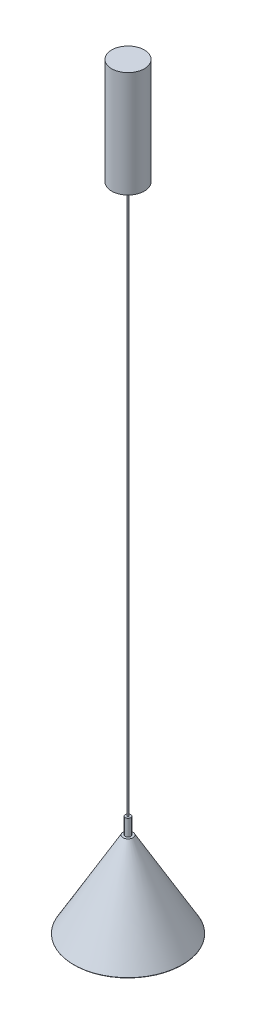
ISO-10303-21;
HEADER;
FILE_DESCRIPTION(('STEP AP214'),'2;1');
FILE_NAME('part.step','',(''),(''),'','','');
FILE_SCHEMA(('AUTOMOTIVE_DESIGN { 1 0 10303 214 1 1 1 1 }'));
ENDSEC;
DATA;
#1=APPLICATION_CONTEXT('core data for automotive mechanical design processes');
#2=APPLICATION_PROTOCOL_DEFINITION('international standard','automotive_design',2000,#1);
#3=PRODUCT_CONTEXT('',#1,'mechanical');
#4=PRODUCT('Part','Part','',(#3));
#5=PRODUCT_RELATED_PRODUCT_CATEGORY('part','',(#4));
#6=PRODUCT_DEFINITION_FORMATION('','',#4);
#7=PRODUCT_DEFINITION_CONTEXT('part definition',#1,'design');
#8=PRODUCT_DEFINITION('design','',#6,#7);
#9=PRODUCT_DEFINITION_SHAPE('','',#8);
#10=(LENGTH_UNIT() NAMED_UNIT(*) SI_UNIT(.MILLI.,.METRE.));
#11=(NAMED_UNIT(*) PLANE_ANGLE_UNIT() SI_UNIT($,.RADIAN.));
#12=(NAMED_UNIT(*) SI_UNIT($,.STERADIAN.) SOLID_ANGLE_UNIT());
#13=UNCERTAINTY_MEASURE_WITH_UNIT(LENGTH_MEASURE(1.E-05),#10,'distance_accuracy_value','');
#14=(GEOMETRIC_REPRESENTATION_CONTEXT(3) GLOBAL_UNCERTAINTY_ASSIGNED_CONTEXT((#13)) GLOBAL_UNIT_ASSIGNED_CONTEXT((#10,
#11,#12)) REPRESENTATION_CONTEXT('',''));
#15=CARTESIAN_POINT('',(0.,0.,0.));
#16=DIRECTION('',(0.,0.,1.));
#17=DIRECTION('',(1.,0.,0.));
#18=AXIS2_PLACEMENT_3D('',#15,#16,#17);
#19=CARTESIAN_POINT('',(0.898823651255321,-734.266598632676,690.));
#20=DIRECTION('',(0.,1.,0.));
#21=DIRECTION('',(-0.980126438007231,0.,0.19837380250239));
#22=AXIS2_PLACEMENT_3D('',#19,#20,#21);
#23=CYLINDRICAL_SURFACE('',#22,5.);
#24=CARTESIAN_POINT('',(0.898823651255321,-734.266598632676,690.));
#25=DIRECTION('',(0.,-1.,0.));
#26=DIRECTION('',(0.980126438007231,0.,-0.19837380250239));
#27=AXIS2_PLACEMENT_3D('',#24,#25,#26);
#28=CIRCLE('',#27,5.);
#29=CARTESIAN_POINT('',(-4.00180853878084,-734.266598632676,690.991869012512));
#30=VERTEX_POINT('',#29);
#31=EDGE_CURVE('P0_E9',#30,#30,#28,.T.);
#32=CARTESIAN_POINT('',(0.898823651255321,-734.256598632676,690.));
#33=DIRECTION('',(0.,-1.,0.));
#34=DIRECTION('',(0.980126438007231,0.,-0.19837380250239));
#35=AXIS2_PLACEMENT_3D('',#32,#33,#34);
#36=CIRCLE('',#35,5.);
#37=CARTESIAN_POINT('',(-4.00180853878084,-734.256598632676,690.991869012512));
#38=VERTEX_POINT('',#37);
#39=EDGE_CURVE('P0_E17',#38,#38,#36,.T.);
#40=CARTESIAN_POINT('',(-4.00180853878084,-734.266598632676,690.991869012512));
#41=CARTESIAN_POINT('',(-4.00180853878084,-734.26649446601,690.991869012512));
#42=CARTESIAN_POINT('',(-4.00180853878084,-734.266390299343,690.991869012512));
#43=CARTESIAN_POINT('',(-4.00180853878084,-734.26618196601,690.991869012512));
#44=CARTESIAN_POINT('',(-4.00180853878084,-734.266077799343,690.991869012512));
#45=CARTESIAN_POINT('',(-4.00180853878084,-734.26586946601,690.991869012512));
#46=CARTESIAN_POINT('',(-4.00180853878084,-734.265765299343,690.991869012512));
#47=CARTESIAN_POINT('',(-4.00180853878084,-734.26555696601,690.991869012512));
#48=CARTESIAN_POINT('',(-4.00180853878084,-734.265452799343,690.991869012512));
#49=CARTESIAN_POINT('',(-4.00180853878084,-734.26524446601,690.991869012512));
#50=CARTESIAN_POINT('',(-4.00180853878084,-734.265140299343,690.991869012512));
#51=CARTESIAN_POINT('',(-4.00180853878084,-734.26493196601,690.991869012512));
#52=CARTESIAN_POINT('',(-4.00180853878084,-734.264827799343,690.991869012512));
#53=CARTESIAN_POINT('',(-4.00180853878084,-734.26461946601,690.991869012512));
#54=CARTESIAN_POINT('',(-4.00180853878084,-734.264515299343,690.991869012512));
#55=CARTESIAN_POINT('',(-4.00180853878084,-734.26430696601,690.991869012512));
#56=CARTESIAN_POINT('',(-4.00180853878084,-734.264202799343,690.991869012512));
#57=CARTESIAN_POINT('',(-4.00180853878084,-734.26399446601,690.991869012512));
#58=CARTESIAN_POINT('',(-4.00180853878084,-734.263890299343,690.991869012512));
#59=CARTESIAN_POINT('',(-4.00180853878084,-734.26368196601,690.991869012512));
#60=CARTESIAN_POINT('',(-4.00180853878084,-734.263577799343,690.991869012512));
#61=CARTESIAN_POINT('',(-4.00180853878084,-734.26336946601,690.991869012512));
#62=CARTESIAN_POINT('',(-4.00180853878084,-734.263265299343,690.991869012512));
#63=CARTESIAN_POINT('',(-4.00180853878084,-734.26305696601,690.991869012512));
#64=CARTESIAN_POINT('',(-4.00180853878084,-734.262952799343,690.991869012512));
#65=CARTESIAN_POINT('',(-4.00180853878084,-734.26274446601,690.991869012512));
#66=CARTESIAN_POINT('',(-4.00180853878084,-734.262640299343,690.991869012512));
#67=CARTESIAN_POINT('',(-4.00180853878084,-734.26243196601,690.991869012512));
#68=CARTESIAN_POINT('',(-4.00180853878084,-734.262327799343,690.991869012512));
#69=CARTESIAN_POINT('',(-4.00180853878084,-734.26211946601,690.991869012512));
#70=CARTESIAN_POINT('',(-4.00180853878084,-734.262015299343,690.991869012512));
#71=CARTESIAN_POINT('',(-4.00180853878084,-734.26180696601,690.991869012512));
#72=CARTESIAN_POINT('',(-4.00180853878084,-734.261702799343,690.991869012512));
#73=CARTESIAN_POINT('',(-4.00180853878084,-734.26149446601,690.991869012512));
#74=CARTESIAN_POINT('',(-4.00180853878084,-734.261390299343,690.991869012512));
#75=CARTESIAN_POINT('',(-4.00180853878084,-734.26118196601,690.991869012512));
#76=CARTESIAN_POINT('',(-4.00180853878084,-734.261077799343,690.991869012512));
#77=CARTESIAN_POINT('',(-4.00180853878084,-734.26086946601,690.991869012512));
#78=CARTESIAN_POINT('',(-4.00180853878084,-734.260765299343,690.991869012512));
#79=CARTESIAN_POINT('',(-4.00180853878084,-734.26055696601,690.991869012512));
#80=CARTESIAN_POINT('',(-4.00180853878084,-734.260452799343,690.991869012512));
#81=CARTESIAN_POINT('',(-4.00180853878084,-734.26024446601,690.991869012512));
#82=CARTESIAN_POINT('',(-4.00180853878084,-734.260140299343,690.991869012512));
#83=CARTESIAN_POINT('',(-4.00180853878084,-734.25993196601,690.991869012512));
#84=CARTESIAN_POINT('',(-4.00180853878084,-734.259827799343,690.991869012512));
#85=CARTESIAN_POINT('',(-4.00180853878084,-734.25961946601,690.991869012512));
#86=CARTESIAN_POINT('',(-4.00180853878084,-734.259515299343,690.991869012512));
#87=CARTESIAN_POINT('',(-4.00180853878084,-734.25930696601,690.991869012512));
#88=CARTESIAN_POINT('',(-4.00180853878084,-734.259202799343,690.991869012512));
#89=CARTESIAN_POINT('',(-4.00180853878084,-734.25899446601,690.991869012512));
#90=CARTESIAN_POINT('',(-4.00180853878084,-734.258890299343,690.991869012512));
#91=CARTESIAN_POINT('',(-4.00180853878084,-734.25868196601,690.991869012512));
#92=CARTESIAN_POINT('',(-4.00180853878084,-734.258577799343,690.991869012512));
#93=CARTESIAN_POINT('',(-4.00180853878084,-734.25836946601,690.991869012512));
#94=CARTESIAN_POINT('',(-4.00180853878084,-734.258265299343,690.991869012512));
#95=CARTESIAN_POINT('',(-4.00180853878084,-734.25805696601,690.991869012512));
#96=CARTESIAN_POINT('',(-4.00180853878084,-734.257952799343,690.991869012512));
#97=CARTESIAN_POINT('',(-4.00180853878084,-734.25774446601,690.991869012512));
#98=CARTESIAN_POINT('',(-4.00180853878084,-734.257640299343,690.991869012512));
#99=CARTESIAN_POINT('',(-4.00180853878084,-734.25743196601,690.991869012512));
#100=CARTESIAN_POINT('',(-4.00180853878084,-734.257327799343,690.991869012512));
#101=CARTESIAN_POINT('',(-4.00180853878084,-734.25711946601,690.991869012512));
#102=CARTESIAN_POINT('',(-4.00180853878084,-734.257015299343,690.991869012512));
#103=CARTESIAN_POINT('',(-4.00180853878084,-734.25680696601,690.991869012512));
#104=CARTESIAN_POINT('',(-4.00180853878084,-734.256702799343,690.991869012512));
#105=CARTESIAN_POINT('',(-4.00180853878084,-734.256598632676,690.991869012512));
#106=B_SPLINE_CURVE_WITH_KNOTS('',3,(#40,#41,#42,#43,#44,#45,#46,#47,#48,#49,#50,#51,#52,#53,
#54,#55,#56,#57,#58,#59,#60,#61,#62,#63,#64,#65,#66,#67,#68,#69,#70,#71,#72,#73,#74,#75,#76,#77,
#78,#79,#80,#81,#82,#83,#84,#85,#86,#87,#88,#89,#90,#91,#92,#93,#94,#95,#96,#97,#98,#99,#100,
#101,#102,#103,#104,#105),.UNSPECIFIED.,.F.,.F.,(4,2,2,2,2,2,2,2,2,2,2,2,2,2,2,2,2,2,2,2,2,2,2,
2,2,2,2,2,2,2,2,2,4),(0.,0.000312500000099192,0.000625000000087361,0.000937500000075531,
0.0012500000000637,0.00156250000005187,0.00187500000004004,0.00218750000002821,
0.0025000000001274,0.00281250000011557,0.00312500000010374,0.00343750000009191,
0.00375000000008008,0.00406250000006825,0.00437500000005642,0.00468750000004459,
0.00500000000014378,0.00531250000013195,0.00562500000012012,0.00593750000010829,
0.00625000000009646,0.00656250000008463,0.0068750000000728,0.00718750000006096,
0.00750000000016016,0.00781250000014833,0.0081250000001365,0.00843750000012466,
0.00875000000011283,0.009062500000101,0.00937500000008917,0.00968750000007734,
0.0100000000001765),.UNSPECIFIED.);
#107=EDGE_CURVE('P0_BSEAM14',#30,#38,#106,.T.);
#108=ORIENTED_EDGE('',*,*,#31,.F.);
#109=ORIENTED_EDGE('',*,*,#39,.T.);
#110=ORIENTED_EDGE('',*,*,#107,.T.);
#111=ORIENTED_EDGE('',*,*,#107,.F.);
#112=EDGE_LOOP('',(#108,#110,#109,#111));
#113=FACE_BOUND('',#112,.T.);
#114=ADVANCED_FACE('P0_F14',(#113),#23,.T.);
#115=CARTESIAN_POINT('',(0.898823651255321,-734.266598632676,690.));
#116=DIRECTION('',(0.,-1.,0.));
#117=DIRECTION('',(0.980126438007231,0.,-0.19837380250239));
#118=AXIS2_PLACEMENT_3D('',#115,#116,#117);
#119=PLANE('',#118);
#120=ORIENTED_EDGE('',*,*,#31,.T.);
#121=EDGE_LOOP('',(#120));
#122=FACE_BOUND('',#121,.T.);
#123=ADVANCED_FACE('P0_F29',(#122),#119,.T.);
#124=CARTESIAN_POINT('',(0.898823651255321,-734.256598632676,690.));
#125=DIRECTION('',(0.,-1.,0.));
#126=DIRECTION('',(0.980126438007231,0.,-0.19837380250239));
#127=AXIS2_PLACEMENT_3D('',#124,#125,#126);
#128=PLANE('',#127);
#129=ORIENTED_EDGE('',*,*,#39,.F.);
#130=EDGE_LOOP('',(#129));
#131=FACE_BOUND('',#130,.T.);
#132=ADVANCED_FACE('P0_F27',(#131),#128,.F.);
#133=CLOSED_SHELL('',(#114,#123,#132));
#134=MANIFOLD_SOLID_BREP('P0_B1',#133);
#135=CARTESIAN_POINT('',(0.89882365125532,-561.63997514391,690.));
#136=DIRECTION('',(0.,-1.,0.));
#137=DIRECTION('',(-0.19837380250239,0.,-0.980126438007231));
#138=AXIS2_PLACEMENT_3D('',#135,#136,#137);
#139=CYLINDRICAL_SURFACE('',#138,5.);
#140=CARTESIAN_POINT('',(0.89882365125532,-561.63997514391,690.));
#141=DIRECTION('',(0.,1.,0.));
#142=DIRECTION('',(0.19837380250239,0.,0.980126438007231));
#143=AXIS2_PLACEMENT_3D('',#140,#141,#142);
#144=CIRCLE('',#143,5.);
#145=CARTESIAN_POINT('',(1.89069266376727,-561.63997514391,694.900632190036));
#146=VERTEX_POINT('',#145);
#147=EDGE_CURVE('P1_E10',#146,#146,#144,.T.);
#148=ORIENTED_EDGE('',*,*,#147,.F.);
#149=EDGE_LOOP('',(#148));
#150=FACE_BOUND('',#149,.T.);
#151=CARTESIAN_POINT('',(0.89882365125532,-591.63997514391,690.));
#152=DIRECTION('',(0.,1.,0.));
#153=DIRECTION('',(0.19837380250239,0.,0.980126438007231));
#154=AXIS2_PLACEMENT_3D('',#151,#152,#153);
#155=CIRCLE('',#154,5.);
#156=CARTESIAN_POINT('',(1.89069266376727,-591.63997514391,694.900632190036));
#157=VERTEX_POINT('',#156);
#158=EDGE_CURVE('P1_E18',#157,#157,#155,.T.);
#159=ORIENTED_EDGE('',*,*,#158,.T.);
#160=EDGE_LOOP('',(#159));
#161=FACE_BOUND('',#160,.T.);
#162=ADVANCED_FACE('P1_F15',(#150,#161),#139,.T.);
#163=CARTESIAN_POINT('',(0.89882365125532,-561.63997514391,690.));
#164=DIRECTION('',(0.,1.,0.));
#165=DIRECTION('',(0.19837380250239,0.,0.980126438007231));
#166=AXIS2_PLACEMENT_3D('',#163,#164,#165);
#167=PLANE('',#166);
#168=ORIENTED_EDGE('',*,*,#147,.T.);
#169=EDGE_LOOP('',(#168));
#170=FACE_BOUND('',#169,.T.);
#171=ADVANCED_FACE('P1_F30',(#170),#167,.T.);
#172=CARTESIAN_POINT('',(0.89882365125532,-591.63997514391,690.));
#173=DIRECTION('',(0.,1.,0.));
#174=DIRECTION('',(0.19837380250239,0.,0.980126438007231));
#175=AXIS2_PLACEMENT_3D('',#172,#173,#174);
#176=PLANE('',#175);
#177=ORIENTED_EDGE('',*,*,#158,.F.);
#178=EDGE_LOOP('',(#177));
#179=FACE_BOUND('',#178,.T.);
#180=ADVANCED_FACE('P1_F28',(#179),#176,.F.);
#181=CLOSED_SHELL('',(#162,#171,#180));
#182=MANIFOLD_SOLID_BREP('P1_B1',#181);
#183=CARTESIAN_POINT('',(0.898823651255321,-732.256598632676,690.));
#184=DIRECTION('',(0.,-1.,0.));
#185=DIRECTION('',(0.980126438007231,0.,-0.19837380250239));
#186=AXIS2_PLACEMENT_3D('',#183,#184,#185);
#187=PLANE('',#186);
#188=CARTESIAN_POINT('',(0.898823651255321,-732.256598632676,690.));
#189=DIRECTION('',(0.,-1.,0.));
#190=DIRECTION('',(0.980126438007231,0.,-0.19837380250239));
#191=AXIS2_PLACEMENT_3D('',#188,#189,#190);
#192=CIRCLE('',#191,86.8452994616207);
#193=CARTESIAN_POINT('',(86.0181976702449,-732.256598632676,672.772167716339));
#194=VERTEX_POINT('',#193);
#195=EDGE_CURVE('P2_E10',#194,#194,#192,.T.);
#196=ORIENTED_EDGE('',*,*,#195,.F.);
#197=EDGE_LOOP('',(#196));
#198=FACE_BOUND('',#197,.T.);
#199=ADVANCED_FACE('P2_F15',(#198),#187,.F.);
#200=CARTESIAN_POINT('',(0.898823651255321,-732.256598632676,690.));
#201=DIRECTION('',(0.,-1.,0.));
#202=DIRECTION('',(0.980126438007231,0.,-0.19837380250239));
#203=AXIS2_PLACEMENT_3D('',#200,#201,#202);
#204=CONICAL_SURFACE('',#203,86.8452994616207,0.523598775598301);
#205=CARTESIAN_POINT('',(0.898823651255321,-734.256598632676,690.));
#206=DIRECTION('',(0.,-1.,0.));
#207=DIRECTION('',(0.980126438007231,0.,-0.19837380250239));
#208=AXIS2_PLACEMENT_3D('',#205,#206,#207);
#209=CIRCLE('',#208,88.);
#210=CARTESIAN_POINT('',(87.1499501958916,-734.256598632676,672.543105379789));
#211=VERTEX_POINT('',#210);
#212=EDGE_CURVE('P2_E21',#211,#211,#209,.T.);
#213=ORIENTED_EDGE('',*,*,#212,.F.);
#214=EDGE_LOOP('',(#213));
#215=FACE_BOUND('',#214,.T.);
#216=ORIENTED_EDGE('',*,*,#195,.T.);
#217=EDGE_LOOP('',(#216));
#218=FACE_BOUND('',#217,.T.);
#219=ADVANCED_FACE('P2_F29',(#215,#218),#204,.T.);
#220=CARTESIAN_POINT('',(-85.352302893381,-734.256598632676,707.45689462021));
#221=DIRECTION('',(0.,1.,0.));
#222=DIRECTION('',(-0.980126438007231,0.,0.19837380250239));
#223=AXIS2_PLACEMENT_3D('',#220,#221,#222);
#224=PLANE('',#223);
#225=ORIENTED_EDGE('',*,*,#212,.T.);
#226=EDGE_LOOP('',(#225));
#227=FACE_BOUND('',#226,.T.);
#228=ADVANCED_FACE('P2_F27',(#227),#224,.F.);
#229=CLOSED_SHELL('',(#199,#219,#228));
#230=MANIFOLD_SOLID_BREP('P2_B1',#229);
#231=CARTESIAN_POINT('',(0.89882365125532,-591.63997514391,690.));
#232=DIRECTION('',(0.,-1.,0.));
#233=DIRECTION('',(-0.19837380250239,0.,-0.980126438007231));
#234=AXIS2_PLACEMENT_3D('',#231,#232,#233);
#235=PLANE('',#234);
#236=CARTESIAN_POINT('',(0.89882365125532,-591.63997514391,690.));
#237=DIRECTION('',(0.,-1.,0.));
#238=DIRECTION('',(-0.19837380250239,0.,-0.980126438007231));
#239=AXIS2_PLACEMENT_3D('',#236,#237,#238);
#240=CIRCLE('',#239,9.);
#241=CARTESIAN_POINT('',(-0.886540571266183,-591.63997514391,681.178862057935));
#242=VERTEX_POINT('',#241);
#243=EDGE_CURVE('P3_E35',#242,#242,#240,.T.);
#244=ORIENTED_EDGE('',*,*,#243,.F.);
#245=EDGE_LOOP('',(#244));
#246=FACE_BOUND('',#245,.T.);
#247=ADVANCED_FACE('P3_F15',(#246),#235,.F.);
#248=CARTESIAN_POINT('',(0.89882365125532,-591.63997514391,690.));
#249=DIRECTION('',(0.,-1.,0.));
#250=DIRECTION('',(-0.19837380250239,0.,-0.980126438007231));
#251=AXIS2_PLACEMENT_3D('',#248,#249,#250);
#252=CONICAL_SURFACE('',#251,9.,0.523598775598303);
#253=CARTESIAN_POINT('',(0.89882365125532,-748.506598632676,690.));
#254=DIRECTION('',(0.,1.,0.));
#255=DIRECTION('',(0.19837380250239,0.,0.980126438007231));
#256=AXIS2_PLACEMENT_3D('',#253,#254,#255);
#257=CIRCLE('',#256,99.5669872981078);
#258=CARTESIAN_POINT('',(-18.8526582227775,-748.506598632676,592.411763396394));
#259=VERTEX_POINT('',#258);
#260=EDGE_CURVE('P3_E22',#259,#259,#257,.T.);
#261=CARTESIAN_POINT('',(-18.8526582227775,-748.506598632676,592.411763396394));
#262=CARTESIAN_POINT('',(-18.6655111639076,-746.872571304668,593.336420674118));
#263=CARTESIAN_POINT('',(-18.4783641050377,-745.23854397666,594.261077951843));
#264=CARTESIAN_POINT('',(-18.1040699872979,-741.970489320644,596.110392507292));
#265=CARTESIAN_POINT('',(-17.9169229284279,-740.336461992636,597.035049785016));
#266=CARTESIAN_POINT('',(-17.5426288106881,-737.06840733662,598.884364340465));
#267=CARTESIAN_POINT('',(-17.3554817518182,-735.434380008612,599.809021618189));
#268=CARTESIAN_POINT('',(-16.9811876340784,-732.166325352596,601.658336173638));
#269=CARTESIAN_POINT('',(-16.7940405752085,-730.532298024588,602.582993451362));
#270=CARTESIAN_POINT('',(-16.4197464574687,-727.264243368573,604.432308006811));
#271=CARTESIAN_POINT('',(-16.2325993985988,-725.630216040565,605.356965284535));
#272=CARTESIAN_POINT('',(-15.8583052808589,-722.362161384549,607.206279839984));
#273=CARTESIAN_POINT('',(-15.671158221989,-720.728134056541,608.130937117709));
#274=CARTESIAN_POINT('',(-15.2968641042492,-717.460079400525,609.980251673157));
#275=CARTESIAN_POINT('',(-15.1097170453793,-715.826052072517,610.904908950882));
#276=CARTESIAN_POINT('',(-14.7354229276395,-712.557997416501,612.754223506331));
#277=CARTESIAN_POINT('',(-14.5482758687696,-710.923970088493,613.678880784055));
#278=CARTESIAN_POINT('',(-14.1739817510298,-707.655915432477,615.528195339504));
#279=CARTESIAN_POINT('',(-13.9868346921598,-706.021888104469,616.452852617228));
#280=CARTESIAN_POINT('',(-13.61254057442,-702.753833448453,618.302167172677));
#281=CARTESIAN_POINT('',(-13.4253935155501,-701.119806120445,619.226824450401));
#282=CARTESIAN_POINT('',(-13.0510993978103,-697.851751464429,621.07613900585));
#283=CARTESIAN_POINT('',(-12.8639523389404,-696.217724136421,622.000796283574));
#284=CARTESIAN_POINT('',(-12.4896582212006,-692.949669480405,623.850110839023));
#285=CARTESIAN_POINT('',(-12.3025111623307,-691.315642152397,624.774768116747));
#286=CARTESIAN_POINT('',(-11.9282170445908,-688.047587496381,626.624082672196));
#287=CARTESIAN_POINT('',(-11.7410699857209,-686.413560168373,627.548739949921));
#288=CARTESIAN_POINT('',(-11.3667758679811,-683.145505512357,629.398054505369));
#289=CARTESIAN_POINT('',(-11.1796288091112,-681.511478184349,630.322711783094));
#290=CARTESIAN_POINT('',(-10.8053346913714,-678.243423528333,632.172026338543));
#291=CARTESIAN_POINT('',(-10.6181876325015,-676.609396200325,633.096683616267));
#292=CARTESIAN_POINT('',(-10.2438935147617,-673.341341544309,634.945998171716));
#293=CARTESIAN_POINT('',(-10.0567464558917,-671.707314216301,635.87065544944));
#294=CARTESIAN_POINT('',(-9.68245233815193,-668.439259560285,637.719970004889));
#295=CARTESIAN_POINT('',(-9.49530527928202,-666.805232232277,638.644627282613));
#296=CARTESIAN_POINT('',(-9.1210111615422,-663.537177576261,640.493941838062));
#297=CARTESIAN_POINT('',(-8.93386410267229,-661.903150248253,641.418599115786));
#298=CARTESIAN_POINT('',(-8.55956998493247,-658.635095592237,643.267913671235));
#299=CARTESIAN_POINT('',(-8.37242292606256,-657.001068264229,644.192570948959));
#300=CARTESIAN_POINT('',(-7.99812880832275,-653.733013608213,646.041885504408));
#301=CARTESIAN_POINT('',(-7.81098174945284,-652.098986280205,646.966542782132));
#302=CARTESIAN_POINT('',(-7.43668763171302,-648.830931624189,648.815857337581));
#303=CARTESIAN_POINT('',(-7.24954057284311,-647.196904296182,649.740514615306));
#304=CARTESIAN_POINT('',(-6.87524645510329,-643.928849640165,651.589829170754));
#305=CARTESIAN_POINT('',(-6.68809939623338,-642.294822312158,652.514486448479));
#306=CARTESIAN_POINT('',(-6.31380527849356,-639.026767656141,654.363801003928));
#307=CARTESIAN_POINT('',(-6.12665821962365,-637.392740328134,655.288458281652));
#308=CARTESIAN_POINT('',(-5.75236410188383,-634.124685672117,657.137772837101));
#309=CARTESIAN_POINT('',(-5.56521704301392,-632.49065834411,658.062430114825));
#310=CARTESIAN_POINT('',(-5.1909229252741,-629.222603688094,659.911744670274));
#311=CARTESIAN_POINT('',(-5.00377586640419,-627.588576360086,660.836401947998));
#312=CARTESIAN_POINT('',(-4.62948174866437,-624.32052170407,662.685716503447));
#313=CARTESIAN_POINT('',(-4.44233468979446,-622.686494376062,663.610373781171));
#314=CARTESIAN_POINT('',(-4.06804057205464,-619.418439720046,665.45968833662));
#315=CARTESIAN_POINT('',(-3.88089351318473,-617.784412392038,666.384345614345));
#316=CARTESIAN_POINT('',(-3.50659939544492,-614.516357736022,668.233660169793));
#317=CARTESIAN_POINT('',(-3.31945233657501,-612.882330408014,669.158317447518));
#318=CARTESIAN_POINT('',(-2.94515821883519,-609.614275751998,671.007632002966));
#319=CARTESIAN_POINT('',(-2.75801115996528,-607.98024842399,671.932289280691));
#320=CARTESIAN_POINT('',(-2.38371704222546,-604.712193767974,673.78160383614));
#321=CARTESIAN_POINT('',(-2.19656998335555,-603.078166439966,674.706261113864));
#322=CARTESIAN_POINT('',(-1.82227586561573,-599.81011178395,676.555575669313));
#323=CARTESIAN_POINT('',(-1.63512880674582,-598.176084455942,677.480232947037));
#324=CARTESIAN_POINT('',(-1.26083468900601,-594.908029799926,679.329547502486));
#325=CARTESIAN_POINT('',(-1.0736876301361,-593.274002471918,680.25420478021));
#326=CARTESIAN_POINT('',(-0.886540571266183,-591.63997514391,681.178862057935));
#327=B_SPLINE_CURVE_WITH_KNOTS('',3,(#261,#262,#263,#264,#265,#266,#267,#268,#269,#270,#271,
#272,#273,#274,#275,#276,#277,#278,#279,#280,#281,#282,#283,#284,#285,#286,#287,#288,#289,#290,
#291,#292,#293,#294,#295,#296,#297,#298,#299,#300,#301,#302,#303,#304,#305,#306,#307,#308,#309,
#310,#311,#312,#313,#314,#315,#316,#317,#318,#319,#320,#321,#322,#323,#324,#325,#326),
.UNSPECIFIED.,.F.,.F.,(4,2,2,2,2,2,2,2,2,2,2,2,2,2,2,2,2,2,2,2,2,2,2,2,2,2,2,2,2,2,2,2,4),(0.,
5.66043670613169,11.3208734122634,16.9813101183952,22.6417468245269,28.3021835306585,
33.9626202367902,39.6230569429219,45.2834936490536,50.9439303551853,56.604367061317,
62.2648037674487,67.9252404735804,73.5856771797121,79.2461138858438,84.9065505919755,
90.5669872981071,96.2274240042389,101.887860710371,107.548297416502,113.208734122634,
118.869170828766,124.529607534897,130.190044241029,135.850480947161,141.510917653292,
147.171354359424,152.831791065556,158.492227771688,164.152664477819,169.813101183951,
175.473537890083,181.133974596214),.UNSPECIFIED.);
#328=EDGE_CURVE('P3_BSEAM58',#259,#242,#327,.T.);
#329=ORIENTED_EDGE('',*,*,#260,.T.);
#330=ORIENTED_EDGE('',*,*,#243,.T.);
#331=ORIENTED_EDGE('',*,*,#328,.T.);
#332=ORIENTED_EDGE('',*,*,#328,.F.);
#333=EDGE_LOOP('',(#329,#331,#330,#332));
#334=FACE_BOUND('',#333,.T.);
#335=ADVANCED_FACE('P3_F58',(#334),#252,.T.);
#336=CARTESIAN_POINT('',(0.89882365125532,-749.256598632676,690.));
#337=DIRECTION('',(0.,1.,0.));
#338=DIRECTION('',(0.19837380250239,0.,0.980126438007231));
#339=AXIS2_PLACEMENT_3D('',#336,#337,#338);
#340=PLANE('',#339);
#341=CARTESIAN_POINT('',(0.89882365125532,-749.256598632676,690.));
#342=DIRECTION('',(0.,1.,0.));
#343=DIRECTION('',(0.19837380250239,0.,0.980126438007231));
#344=AXIS2_PLACEMENT_3D('',#341,#342,#343);
#345=CIRCLE('',#344,99.1339745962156);
#346=CARTESIAN_POINT('',(20.5644071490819,-749.256598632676,787.163829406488));
#347=VERTEX_POINT('',#346);
#348=EDGE_CURVE('P3_E26',#347,#347,#345,.F.);
#349=ORIENTED_EDGE('',*,*,#348,.T.);
#350=EDGE_LOOP('',(#349));
#351=FACE_BOUND('',#350,.T.);
#352=CARTESIAN_POINT('',(0.89882365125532,-749.256598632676,690.));
#353=DIRECTION('',(0.,1.,0.));
#354=DIRECTION('',(0.19837380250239,0.,0.980126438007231));
#355=AXIS2_PLACEMENT_3D('',#352,#353,#354);
#356=CIRCLE('',#355,97.9792740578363);
#357=CARTESIAN_POINT('',(20.3353448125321,-749.256598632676,786.032076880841));
#358=VERTEX_POINT('',#357);
#359=EDGE_CURVE('P3_E30',#358,#358,#356,.T.);
#360=ORIENTED_EDGE('',*,*,#359,.T.);
#361=EDGE_LOOP('',(#360));
#362=FACE_BOUND('',#361,.T.);
#363=ADVANCED_FACE('P3_F54',(#351,#362),#340,.F.);
#364=CARTESIAN_POINT('',(0.89882365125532,-593.63997514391,690.));
#365=DIRECTION('',(0.,-1.,0.));
#366=DIRECTION('',(-0.19837380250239,0.,-0.980126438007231));
#367=AXIS2_PLACEMENT_3D('',#364,#365,#366);
#368=PLANE('',#367);
#369=CARTESIAN_POINT('',(0.89882365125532,-593.63997514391,690.));
#370=DIRECTION('',(0.,-1.,0.));
#371=DIRECTION('',(-0.19837380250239,0.,-0.980126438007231));
#372=AXIS2_PLACEMENT_3D('',#369,#370,#371);
#373=CIRCLE('',#372,7.84529946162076);
#374=CARTESIAN_POINT('',(-0.657478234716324,-593.63997514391,682.310614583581));
#375=VERTEX_POINT('',#374);
#376=EDGE_CURVE('P3_E38',#375,#375,#373,.T.);
#377=ORIENTED_EDGE('',*,*,#376,.T.);
#378=EDGE_LOOP('',(#377));
#379=FACE_BOUND('',#378,.T.);
#380=ADVANCED_FACE('P3_F42',(#379),#368,.T.);
#381=CARTESIAN_POINT('',(0.89882365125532,-592.63997514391,690.));
#382=DIRECTION('',(0.,-1.,0.));
#383=DIRECTION('',(-0.19837380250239,0.,-0.980126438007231));
#384=AXIS2_PLACEMENT_3D('',#381,#382,#383);
#385=CONICAL_SURFACE('',#384,7.26794919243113,0.523598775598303);
#386=CARTESIAN_POINT('',(0.89882365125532,-749.006598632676,690.));
#387=DIRECTION('',(0.,-1.,0.));
#388=DIRECTION('',(-0.19837380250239,0.,-0.980126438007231));
#389=AXIS2_PLACEMENT_3D('',#386,#387,#388);
#390=CIRCLE('',#389,97.5462613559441);
#391=CARTESIAN_POINT('',(-18.4517991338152,-749.006598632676,594.392330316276));
#392=VERTEX_POINT('',#391);
#393=EDGE_CURVE('P3_E10',#392,#392,#390,.T.);
#394=CARTESIAN_POINT('',(-18.4517991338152,-749.006598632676,594.392330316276));
#395=CARTESIAN_POINT('',(-18.2664416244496,-747.388196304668,595.308145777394));
#396=CARTESIAN_POINT('',(-18.081084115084,-745.76979397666,596.223961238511));
#397=CARTESIAN_POINT('',(-17.7103690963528,-742.532989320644,598.055592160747));
#398=CARTESIAN_POINT('',(-17.5250115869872,-740.914586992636,598.971407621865));
#399=CARTESIAN_POINT('',(-17.1542965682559,-737.67778233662,600.8030385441));
#400=CARTESIAN_POINT('',(-16.9689390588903,-736.059380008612,601.718854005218));
#401=CARTESIAN_POINT('',(-16.5982240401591,-732.822575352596,603.550484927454));
#402=CARTESIAN_POINT('',(-16.4128665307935,-731.204173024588,604.466300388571));
#403=CARTESIAN_POINT('',(-16.0421515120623,-727.967368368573,606.297931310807));
#404=CARTESIAN_POINT('',(-15.8567940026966,-726.348966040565,607.213746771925));
#405=CARTESIAN_POINT('',(-15.4860789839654,-723.112161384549,609.04537769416));
#406=CARTESIAN_POINT('',(-15.3007214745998,-721.493759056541,609.961193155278));
#407=CARTESIAN_POINT('',(-14.9300064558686,-718.256954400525,611.792824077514));
#408=CARTESIAN_POINT('',(-14.744648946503,-716.638552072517,612.708639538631));
#409=CARTESIAN_POINT('',(-14.3739339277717,-713.401747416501,614.540270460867));
#410=CARTESIAN_POINT('',(-14.1885764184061,-711.783345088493,615.456085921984));
#411=CARTESIAN_POINT('',(-13.8178613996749,-708.546540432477,617.28771684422));
#412=CARTESIAN_POINT('',(-13.6325038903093,-706.928138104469,618.203532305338));
#413=CARTESIAN_POINT('',(-13.2617888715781,-703.691333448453,620.035163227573));
#414=CARTESIAN_POINT('',(-13.0764313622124,-702.072931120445,620.950978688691));
#415=CARTESIAN_POINT('',(-12.7057163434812,-698.836126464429,622.782609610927));
#416=CARTESIAN_POINT('',(-12.5203588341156,-697.217724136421,623.698425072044));
#417=CARTESIAN_POINT('',(-12.1496438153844,-693.980919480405,625.53005599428));
#418=CARTESIAN_POINT('',(-11.9642863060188,-692.362517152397,626.445871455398));
#419=CARTESIAN_POINT('',(-11.5935712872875,-689.125712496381,628.277502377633));
#420=CARTESIAN_POINT('',(-11.4082137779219,-687.507310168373,629.193317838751));
#421=CARTESIAN_POINT('',(-11.0374987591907,-684.270505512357,631.024948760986));
#422=CARTESIAN_POINT('',(-10.8521412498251,-682.652103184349,631.940764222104));
#423=CARTESIAN_POINT('',(-10.4814262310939,-679.415298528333,633.77239514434));
#424=CARTESIAN_POINT('',(-10.2960687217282,-677.796896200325,634.688210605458));
#425=CARTESIAN_POINT('',(-9.92535370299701,-674.560091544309,636.519841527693));
#426=CARTESIAN_POINT('',(-9.73999619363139,-672.941689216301,637.435656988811));
#427=CARTESIAN_POINT('',(-9.36928117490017,-669.704884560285,639.267287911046));
#428=CARTESIAN_POINT('',(-9.18392366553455,-668.086482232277,640.183103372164));
#429=CARTESIAN_POINT('',(-8.81320864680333,-664.849677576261,642.0147342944));
#430=CARTESIAN_POINT('',(-8.62785113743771,-663.231275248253,642.930549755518));
#431=CARTESIAN_POINT('',(-8.25713611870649,-659.994470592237,644.762180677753));
#432=CARTESIAN_POINT('',(-8.07177860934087,-658.376068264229,645.677996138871));
#433=CARTESIAN_POINT('',(-7.70106359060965,-655.139263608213,647.509627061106));
#434=CARTESIAN_POINT('',(-7.51570608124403,-653.520861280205,648.425442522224));
#435=CARTESIAN_POINT('',(-7.14499106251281,-650.284056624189,650.25707344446));
#436=CARTESIAN_POINT('',(-6.95963355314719,-648.665654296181,651.172888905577));
#437=CARTESIAN_POINT('',(-6.58891853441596,-645.428849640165,653.004519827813));
#438=CARTESIAN_POINT('',(-6.40356102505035,-643.810447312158,653.920335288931));
#439=CARTESIAN_POINT('',(-6.03284600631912,-640.573642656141,655.751966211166));
#440=CARTESIAN_POINT('',(-5.84748849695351,-638.955240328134,656.667781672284));
#441=CARTESIAN_POINT('',(-5.47677347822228,-635.718435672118,658.49941259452));
#442=CARTESIAN_POINT('',(-5.29141596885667,-634.10003334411,659.415228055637));
#443=CARTESIAN_POINT('',(-4.92070095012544,-630.863228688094,661.246858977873));
#444=CARTESIAN_POINT('',(-4.73534344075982,-629.244826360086,662.162674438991));
#445=CARTESIAN_POINT('',(-4.3646284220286,-626.00802170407,663.994305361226));
#446=CARTESIAN_POINT('',(-4.17927091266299,-624.389619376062,664.910120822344));
#447=CARTESIAN_POINT('',(-3.80855589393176,-621.152814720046,666.741751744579));
#448=CARTESIAN_POINT('',(-3.62319838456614,-619.534412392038,667.657567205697));
#449=CARTESIAN_POINT('',(-3.25248336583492,-616.297607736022,669.489198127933));
#450=CARTESIAN_POINT('',(-3.0671258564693,-614.679205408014,670.40501358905));
#451=CARTESIAN_POINT('',(-2.69641083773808,-611.442400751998,672.236644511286));
#452=CARTESIAN_POINT('',(-2.51105332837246,-609.82399842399,673.152459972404));
#453=CARTESIAN_POINT('',(-2.14033830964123,-606.587193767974,674.984090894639));
#454=CARTESIAN_POINT('',(-1.95498080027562,-604.968791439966,675.899906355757));
#455=CARTESIAN_POINT('',(-1.58426578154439,-601.73198678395,677.731537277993));
#456=CARTESIAN_POINT('',(-1.39890827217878,-600.113584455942,678.64735273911));
#457=CARTESIAN_POINT('',(-1.02819325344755,-596.876779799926,680.478983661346));
#458=CARTESIAN_POINT('',(-0.842835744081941,-595.258377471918,681.394799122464));
#459=CARTESIAN_POINT('',(-0.657478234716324,-593.63997514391,682.310614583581));
#460=B_SPLINE_CURVE_WITH_KNOTS('',3,(#394,#395,#396,#397,#398,#399,#400,#401,#402,#403,#404,
#405,#406,#407,#408,#409,#410,#411,#412,#413,#414,#415,#416,#417,#418,#419,#420,#421,#422,#423,
#424,#425,#426,#427,#428,#429,#430,#431,#432,#433,#434,#435,#436,#437,#438,#439,#440,#441,#442,
#443,#444,#445,#446,#447,#448,#449,#450,#451,#452,#453,#454,#455,#456,#457,#458,#459),
.UNSPECIFIED.,.F.,.F.,(4,2,2,2,2,2,2,2,2,2,2,2,2,2,2,2,2,2,2,2,2,2,2,2,2,2,2,2,2,2,2,2,4),(0.,
5.60631011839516,11.2126202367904,16.8189303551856,22.4252404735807,28.0315505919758,
33.6378607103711,39.2441708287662,44.8504809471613,50.4567910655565,56.0631011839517,
61.6694113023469,67.2757214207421,72.8820315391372,78.4883416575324,84.0946517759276,
89.7009618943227,95.3072720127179,100.913582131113,106.519892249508,112.126202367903,
117.732512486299,123.338822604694,128.945132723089,134.551442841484,140.157752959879,
145.764063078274,151.37037319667,156.976683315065,162.58299343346,168.189303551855,
173.79561367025,179.401923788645),.UNSPECIFIED.);
#461=EDGE_CURVE('P3_BSEAM44',#392,#375,#460,.T.);
#462=ORIENTED_EDGE('',*,*,#393,.T.);
#463=ORIENTED_EDGE('',*,*,#376,.F.);
#464=ORIENTED_EDGE('',*,*,#461,.T.);
#465=ORIENTED_EDGE('',*,*,#461,.F.);
#466=EDGE_LOOP('',(#462,#464,#463,#465));
#467=FACE_BOUND('',#466,.T.);
#468=ADVANCED_FACE('P3_F44',(#467),#385,.F.);
#469=CARTESIAN_POINT('',(0.89882365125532,-748.756598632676,690.));
#470=DIRECTION('',(0.,1.,0.));
#471=DIRECTION('',(0.19837380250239,0.,0.980126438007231));
#472=AXIS2_PLACEMENT_3D('',#469,#470,#471);
#473=TOROIDAL_SURFACE('',#472,99.1339745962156,0.5);
#474=ORIENTED_EDGE('',*,*,#260,.F.);
#475=EDGE_LOOP('',(#474));
#476=FACE_BOUND('',#475,.T.);
#477=ORIENTED_EDGE('',*,*,#348,.F.);
#478=EDGE_LOOP('',(#477));
#479=FACE_BOUND('',#478,.T.);
#480=ADVANCED_FACE('P3_F46',(#476,#479),#473,.T.);
#481=CARTESIAN_POINT('',(0.89882365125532,-748.756598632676,690.));
#482=DIRECTION('',(0.,1.,0.));
#483=DIRECTION('',(0.19837380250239,0.,0.980126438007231));
#484=AXIS2_PLACEMENT_3D('',#481,#482,#483);
#485=TOROIDAL_SURFACE('',#484,97.9792740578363,0.5);
#486=ORIENTED_EDGE('',*,*,#359,.F.);
#487=EDGE_LOOP('',(#486));
#488=FACE_BOUND('',#487,.T.);
#489=ORIENTED_EDGE('',*,*,#393,.F.);
#490=EDGE_LOOP('',(#489));
#491=FACE_BOUND('',#490,.T.);
#492=ADVANCED_FACE('P3_F17',(#488,#491),#485,.T.);
#493=CLOSED_SHELL('',(#247,#335,#363,#380,#468,#480,#492));
#494=MANIFOLD_SOLID_BREP('P3_B1',#493);
#495=CARTESIAN_POINT('',(0.898823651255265,643.36002485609,690.));
#496=DIRECTION('',(0.,-1.,0.));
#497=DIRECTION('',(0.,0.,-1.));
#498=AXIS2_PLACEMENT_3D('',#495,#496,#497);
#499=CYLINDRICAL_SURFACE('',#498,30.);
#500=CARTESIAN_POINT('',(0.898823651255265,643.36002485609,690.));
#501=DIRECTION('',(0.,1.,0.));
#502=DIRECTION('',(0.,0.,1.));
#503=AXIS2_PLACEMENT_3D('',#500,#501,#502);
#504=CIRCLE('',#503,30.);
#505=CARTESIAN_POINT('',(0.898823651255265,643.36002485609,720.));
#506=VERTEX_POINT('',#505);
#507=EDGE_CURVE('P4_E10',#506,#506,#504,.T.);
#508=ORIENTED_EDGE('',*,*,#507,.F.);
#509=EDGE_LOOP('',(#508));
#510=FACE_BOUND('',#509,.T.);
#511=CARTESIAN_POINT('',(0.898823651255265,448.36002485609,690.));
#512=DIRECTION('',(0.,1.,0.));
#513=DIRECTION('',(0.,0.,1.));
#514=AXIS2_PLACEMENT_3D('',#511,#512,#513);
#515=CIRCLE('',#514,30.);
#516=CARTESIAN_POINT('',(0.898823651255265,448.36002485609,720.));
#517=VERTEX_POINT('',#516);
#518=EDGE_CURVE('P4_E18',#517,#517,#515,.T.);
#519=ORIENTED_EDGE('',*,*,#518,.T.);
#520=EDGE_LOOP('',(#519));
#521=FACE_BOUND('',#520,.T.);
#522=ADVANCED_FACE('P4_F15',(#510,#521),#499,.T.);
#523=CARTESIAN_POINT('',(0.898823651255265,643.36002485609,690.));
#524=DIRECTION('',(0.,1.,0.));
#525=DIRECTION('',(0.,0.,1.));
#526=AXIS2_PLACEMENT_3D('',#523,#524,#525);
#527=PLANE('',#526);
#528=ORIENTED_EDGE('',*,*,#507,.T.);
#529=EDGE_LOOP('',(#528));
#530=FACE_BOUND('',#529,.T.);
#531=ADVANCED_FACE('P4_F30',(#530),#527,.T.);
#532=CARTESIAN_POINT('',(0.898823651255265,448.36002485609,690.));
#533=DIRECTION('',(0.,1.,0.));
#534=DIRECTION('',(0.,0.,1.));
#535=AXIS2_PLACEMENT_3D('',#532,#533,#534);
#536=PLANE('',#535);
#537=ORIENTED_EDGE('',*,*,#518,.F.);
#538=EDGE_LOOP('',(#537));
#539=FACE_BOUND('',#538,.T.);
#540=ADVANCED_FACE('P4_F28',(#539),#536,.F.);
#541=CLOSED_SHELL('',(#522,#531,#540));
#542=MANIFOLD_SOLID_BREP('P4_B1',#541);
#543=CARTESIAN_POINT('',(0.898823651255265,-561.63997514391,690.));
#544=DIRECTION('',(0.,1.,0.));
#545=DIRECTION('',(0.,0.,1.));
#546=AXIS2_PLACEMENT_3D('',#543,#544,#545);
#547=CYLINDRICAL_SURFACE('',#546,1.5);
#548=CARTESIAN_POINT('',(0.898823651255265,-561.63997514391,690.));
#549=DIRECTION('',(0.,-1.,0.));
#550=DIRECTION('',(0.,0.,-1.));
#551=AXIS2_PLACEMENT_3D('',#548,#549,#550);
#552=CIRCLE('',#551,1.5);
#553=CARTESIAN_POINT('',(0.898823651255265,-561.63997514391,688.5));
#554=VERTEX_POINT('',#553);
#555=EDGE_CURVE('P5_E10',#554,#554,#552,.T.);
#556=ORIENTED_EDGE('',*,*,#555,.F.);
#557=EDGE_LOOP('',(#556));
#558=FACE_BOUND('',#557,.T.);
#559=CARTESIAN_POINT('',(0.898823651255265,438.36002485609,690.));
#560=DIRECTION('',(0.,-1.,0.));
#561=DIRECTION('',(0.,0.,-1.));
#562=AXIS2_PLACEMENT_3D('',#559,#560,#561);
#563=CIRCLE('',#562,1.5);
#564=CARTESIAN_POINT('',(0.898823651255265,438.36002485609,688.5));
#565=VERTEX_POINT('',#564);
#566=EDGE_CURVE('P5_E18',#565,#565,#563,.T.);
#567=ORIENTED_EDGE('',*,*,#566,.T.);
#568=EDGE_LOOP('',(#567));
#569=FACE_BOUND('',#568,.T.);
#570=ADVANCED_FACE('P5_F15',(#558,#569),#547,.T.);
#571=CARTESIAN_POINT('',(0.898823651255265,-561.63997514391,690.));
#572=DIRECTION('',(0.,-1.,0.));
#573=DIRECTION('',(0.,0.,-1.));
#574=AXIS2_PLACEMENT_3D('',#571,#572,#573);
#575=PLANE('',#574);
#576=ORIENTED_EDGE('',*,*,#555,.T.);
#577=EDGE_LOOP('',(#576));
#578=FACE_BOUND('',#577,.T.);
#579=ADVANCED_FACE('P5_F30',(#578),#575,.T.);
#580=CARTESIAN_POINT('',(0.898823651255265,438.36002485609,690.));
#581=DIRECTION('',(0.,-1.,0.));
#582=DIRECTION('',(0.,0.,-1.));
#583=AXIS2_PLACEMENT_3D('',#580,#581,#582);
#584=PLANE('',#583);
#585=ORIENTED_EDGE('',*,*,#566,.F.);
#586=EDGE_LOOP('',(#585));
#587=FACE_BOUND('',#586,.T.);
#588=ADVANCED_FACE('P5_F28',(#587),#584,.F.);
#589=CLOSED_SHELL('',(#570,#579,#588));
#590=MANIFOLD_SOLID_BREP('P5_B1',#589);
#591=CARTESIAN_POINT('',(0.898823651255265,438.36002485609,690.));
#592=DIRECTION('',(0.,1.,0.));
#593=DIRECTION('',(0.,0.,1.));
#594=AXIS2_PLACEMENT_3D('',#591,#592,#593);
#595=CYLINDRICAL_SURFACE('',#594,6.);
#596=CARTESIAN_POINT('',(0.898823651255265,438.36002485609,690.));
#597=DIRECTION('',(0.,-1.,0.));
#598=DIRECTION('',(0.,0.,-1.));
#599=AXIS2_PLACEMENT_3D('',#596,#597,#598);
#600=CIRCLE('',#599,6.);
#601=CARTESIAN_POINT('',(0.898823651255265,438.36002485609,684.));
#602=VERTEX_POINT('',#601);
#603=EDGE_CURVE('P6_E10',#602,#602,#600,.T.);
#604=ORIENTED_EDGE('',*,*,#603,.F.);
#605=EDGE_LOOP('',(#604));
#606=FACE_BOUND('',#605,.T.);
#607=CARTESIAN_POINT('',(0.898823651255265,448.36002485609,690.));
#608=DIRECTION('',(0.,-1.,0.));
#609=DIRECTION('',(0.,0.,-1.));
#610=AXIS2_PLACEMENT_3D('',#607,#608,#609);
#611=CIRCLE('',#610,6.);
#612=CARTESIAN_POINT('',(0.898823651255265,448.36002485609,684.));
#613=VERTEX_POINT('',#612);
#614=EDGE_CURVE('P6_E18',#613,#613,#611,.T.);
#615=ORIENTED_EDGE('',*,*,#614,.T.);
#616=EDGE_LOOP('',(#615));
#617=FACE_BOUND('',#616,.T.);
#618=ADVANCED_FACE('P6_F15',(#606,#617),#595,.T.);
#619=CARTESIAN_POINT('',(0.898823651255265,438.36002485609,690.));
#620=DIRECTION('',(0.,-1.,0.));
#621=DIRECTION('',(0.,0.,-1.));
#622=AXIS2_PLACEMENT_3D('',#619,#620,#621);
#623=PLANE('',#622);
#624=ORIENTED_EDGE('',*,*,#603,.T.);
#625=EDGE_LOOP('',(#624));
#626=FACE_BOUND('',#625,.T.);
#627=ADVANCED_FACE('P6_F30',(#626),#623,.T.);
#628=CARTESIAN_POINT('',(0.898823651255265,448.36002485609,690.));
#629=DIRECTION('',(0.,-1.,0.));
#630=DIRECTION('',(0.,0.,-1.));
#631=AXIS2_PLACEMENT_3D('',#628,#629,#630);
#632=PLANE('',#631);
#633=ORIENTED_EDGE('',*,*,#614,.F.);
#634=EDGE_LOOP('',(#633));
#635=FACE_BOUND('',#634,.T.);
#636=ADVANCED_FACE('P6_F28',(#635),#632,.F.);
#637=CLOSED_SHELL('',(#618,#627,#636));
#638=MANIFOLD_SOLID_BREP('P6_B1',#637);
#639=ADVANCED_BREP_SHAPE_REPRESENTATION('',(#18,#134,#182,#230,#494,#542,#590,#638),#14);
#640=SHAPE_DEFINITION_REPRESENTATION(#9,#639);
ENDSEC;
END-ISO-10303-21;
